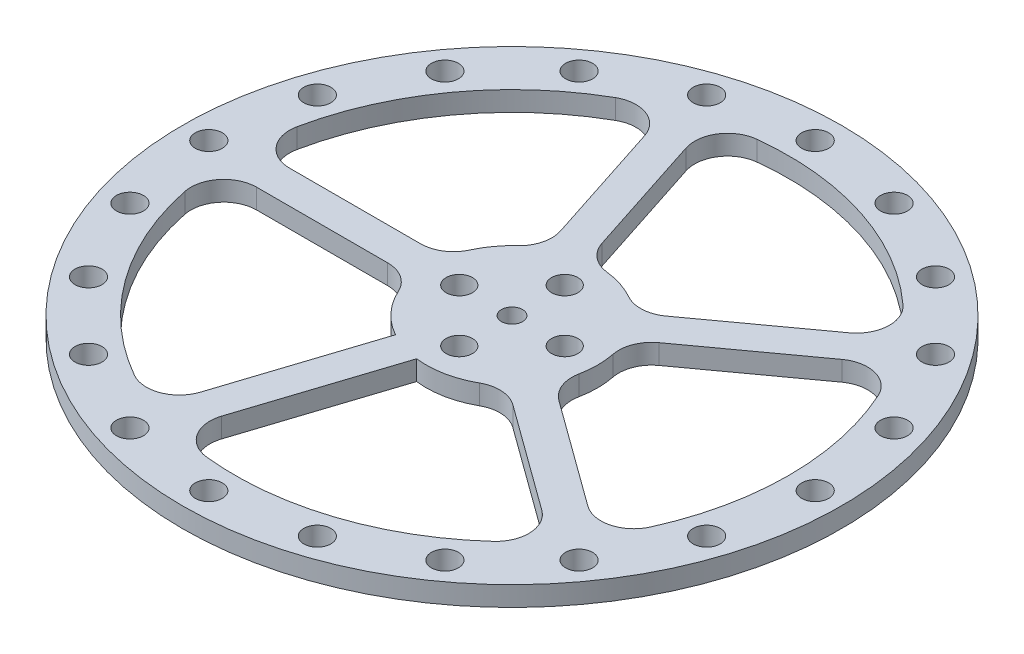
from build123d import *

# Parameters (mm, degrees)
SKETCH1_R               = 50
BOSS_EXTRUDE1_DEPTH     = 3
CUT_EXTRUDE1_DEPTH      = 71.774289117
CUT_EXTRUDE1_DEPTH_BACK = 71.774289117
SKETCH2_R               = 1.6
CUT_EXTRUDE2_DEPTH      = 71.774289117
CUT_EXTRUDE2_DEPTH_BACK = 71.774289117
FILLET1_R               = 5
FILLET2_R               = 5
SKETCH5_R               = 2.05
CUT_EXTRUDE3_DEPTH      = 71.774289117
CIRPATTERN1_COUNT       = 20
SKETCH6_R               = 2
CUT_EXTRUDE4_DEPTH      = 71.774289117
CIRPATTERN2_COUNT       = 4


with BuildPart() as part:
    # Sketch1 → Boss-Extrude1 (new body)
    with BuildSketch(Plane(origin=(0, 0, 0), x_dir=(1, 0, 0), z_dir=(0, 1, 0))):
        with Locations(Location((0, 0, 0), (0, 0, 270))):
            Circle(SKETCH1_R)
    extrude(amount=BOSS_EXTRUDE1_DEPTH)

    # Sketch2 → Cut-Extrude1 (cut, two sides: drawn at the far end of the back side and taken through both)
    with BuildSketch(Plane(origin=(0, 3, 0), x_dir=(1, 0, 0), z_dir=(0, 1, 0)).offset(-CUT_EXTRUDE1_DEPTH_BACK)):
        with Locations(Location((0, 0, 0), (0, 0, 270))):
            Circle(SKETCH2_R)
    extrude(amount=CUT_EXTRUDE1_DEPTH + CUT_EXTRUDE1_DEPTH_BACK, mode=Mode.SUBTRACT)

    # Sketch4 → Cut-Extrude2 (cut, two sides: drawn at the far end of the back side and taken through both)
    with BuildSketch(Plane(origin=(0, 3, 0), x_dir=(1, 0, 0), z_dir=(0, 1, 0)).offset(-CUT_EXTRUDE2_DEPTH_BACK)):
        with BuildLine():
            ThreePointArc((-6.319879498, -11.360419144), (-10.517220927, -7.64120828), (-12.757350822, -2.5))
            Line((-12.757350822, -2.5), (-41.925529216, -2.5))
            ThreePointArc((-41.925529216, -2.5), (-33.978713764, -24.686980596), (-15.333342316, -39.101005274))
            Line((-15.333342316, -39.101005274), (-6.319879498, -11.360419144))
        make_face()
        with BuildLine():
            Line((-6.319879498, 11.360419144), (-15.333342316, 39.101005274))
            ThreePointArc((-15.333342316, 39.101005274), (-33.978713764, 24.686980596), (-41.925529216, 2.5))
            Line((-41.925529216, 2.5), (-12.757350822, 2.5))
            ThreePointArc((-12.757350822, 2.5), (-10.517220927, 7.64120828), (-6.319879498, 11.360419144))
        make_face()
        with BuildLine():
            ThreePointArc((32.449002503, 26.665750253), (12.978713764, 39.944373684), (-10.578059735, 40.646090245))
            Line((-10.578059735, 40.646090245), (-1.564596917, 12.905504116))
            ThreePointArc((-1.564596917, 12.905504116), (4.017220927, 12.363734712), (8.851450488, 9.521125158))
            Line((8.851450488, 9.521125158), (32.449002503, 26.665750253))
        make_face()
        with BuildLine():
            ThreePointArc((42, 0), (40.31310586, 11.783611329), (35.387928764, 22.620665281))
            Line((35.387928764, 22.620665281), (11.790376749, 5.476040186))
            ThreePointArc((11.790376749, 5.476040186), (12.693992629, 2.804024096), (13, 0))
            ThreePointArc((13, 0), (12.693992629, -2.804024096), (11.790376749, -5.476040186))
            Line((11.790376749, -5.476040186), (35.387928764, -22.620665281))
            ThreePointArc((35.387928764, -22.620665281), (40.31310586, -11.783611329), (42, 0))
        make_face()
        with BuildLine():
            ThreePointArc((-10.578059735, -40.646090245), (12.978713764, -39.944373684), (32.449002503, -26.665750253))
            Line((32.449002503, -26.665750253), (8.851450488, -9.521125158))
            ThreePointArc((8.851450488, -9.521125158), (4.017220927, -12.363734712), (-1.564596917, -12.905504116))
            Line((-1.564596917, -12.905504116), (-10.578059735, -40.646090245))
        make_face()
    extrude(amount=CUT_EXTRUDE2_DEPTH + CUT_EXTRUDE2_DEPTH_BACK, mode=Mode.SUBTRACT)

    # Fillet1
    fillet1_edges = [part.edges().sort_by_distance(p)[0] for p in [
        (-10.578059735, 1.5, -40.646090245),
        (32.449002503, 1.5, -26.665750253),
        (-41.925529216, 1.5, -2.5),
        (-15.333342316, 1.5, -39.101005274),
        (32.449002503, 1.5, 26.665750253),
        (-10.578059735, 1.5, 40.646090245),
        (35.387928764, 1.5, -22.620665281),
        (35.387928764, 1.5, 22.620665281),
        (-15.333342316, 1.5, 39.101005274),
        (-41.925529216, 1.5, 2.5),
    ]]
    fillet(fillet1_edges, radius=FILLET1_R)

    # Fillet2
    fillet2_edges = [part.edges().sort_by_distance(p)[0] for p in [
        (8.851450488, 1.5, -9.521125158),
        (-1.564596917, 1.5, -12.905504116),
        (-6.319879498, 1.5, -11.360419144),
        (-12.757350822, 1.5, -2.5),
        (8.851450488, 1.5, 9.521125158),
        (11.790376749, 1.5, 5.476040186),
        (11.790376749, 1.5, -5.476040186),
        (-12.757350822, 1.5, 2.5),
    ]]
    fillet(fillet2_edges, radius=FILLET2_R)

    # Sketch5 → Cut-Extrude3 (cut, through all)
    with BuildSketch(Plane(origin=(0, 3, 0), x_dir=(1, 0, 0), z_dir=(0, 1, 0))):
        with Locations(Location((0, 46, 0), (0, 0, 270))):
            Circle(SKETCH5_R)
    cut_extrude3 = extrude(amount=-CUT_EXTRUDE3_DEPTH, mode=Mode.SUBTRACT)

    # CirPattern1: Cut-Extrude3 ×20 about axis
    cirpattern1_axis = Axis((0, 0, 0), (0, 1, 0))
    for i in range(1, CIRPATTERN1_COUNT):
        add(cut_extrude3.rotate(cirpattern1_axis, i * 360 / CIRPATTERN1_COUNT), mode=Mode.SUBTRACT)

    # Sketch6 → Cut-Extrude4 (cut, through all)
    with BuildSketch(Plane(origin=(0, 3, 0), x_dir=(1, 0, 0), z_dir=(0, 1, 0))):
        with Locations(Location((0, 8, 0), (0, 0, 270))):
            Circle(SKETCH6_R)
    cut_extrude4 = extrude(amount=-CUT_EXTRUDE4_DEPTH, mode=Mode.SUBTRACT)

    # CirPattern2: Cut-Extrude4 ×4 about axis
    cirpattern2_axis = Axis((0, 0, 0), (0, 1, 0))
    for i in range(1, CIRPATTERN2_COUNT):
        add(cut_extrude4.rotate(cirpattern2_axis, i * 360 / CIRPATTERN2_COUNT), mode=Mode.SUBTRACT)


solid = part.part
